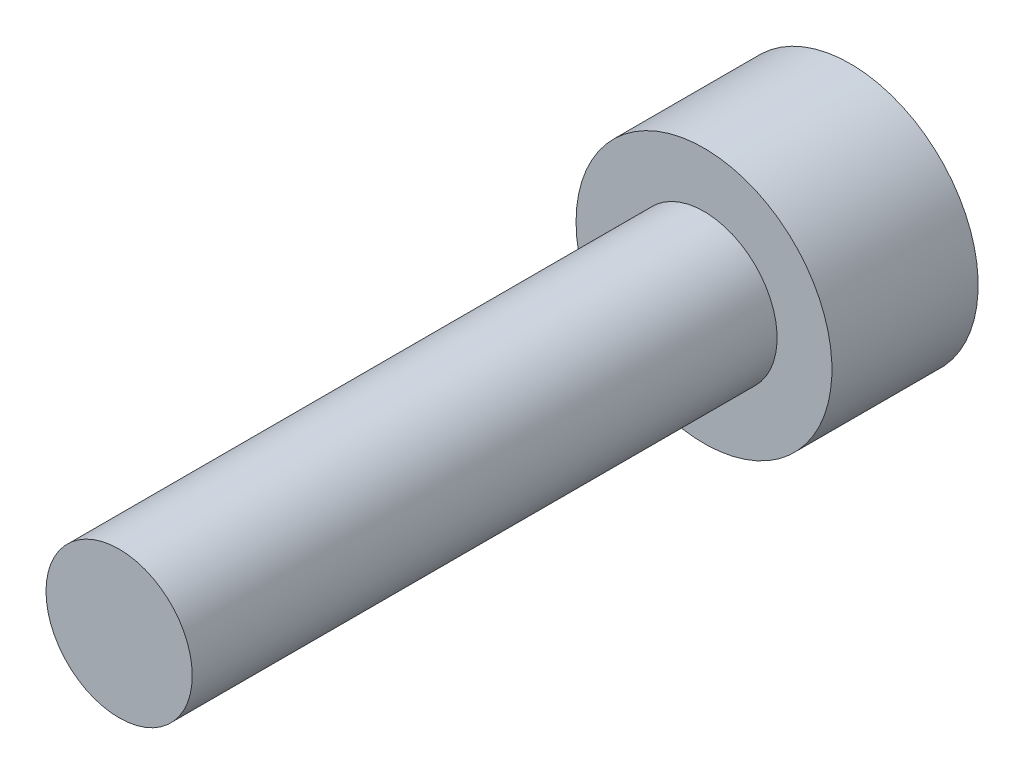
ISO-10303-21;
HEADER;
FILE_DESCRIPTION(('STEP AP214'),'2;1');
FILE_NAME('part.step','',(''),(''),'','','');
FILE_SCHEMA(('AUTOMOTIVE_DESIGN { 1 0 10303 214 1 1 1 1 }'));
ENDSEC;
DATA;
#1=APPLICATION_CONTEXT('core data for automotive mechanical design processes');
#2=APPLICATION_PROTOCOL_DEFINITION('international standard','automotive_design',2000,#1);
#3=PRODUCT_CONTEXT('',#1,'mechanical');
#4=PRODUCT('Part','Part','',(#3));
#5=PRODUCT_RELATED_PRODUCT_CATEGORY('part','',(#4));
#6=PRODUCT_DEFINITION_FORMATION('','',#4);
#7=PRODUCT_DEFINITION_CONTEXT('part definition',#1,'design');
#8=PRODUCT_DEFINITION('design','',#6,#7);
#9=PRODUCT_DEFINITION_SHAPE('','',#8);
#10=(LENGTH_UNIT() NAMED_UNIT(*) SI_UNIT(.MILLI.,.METRE.));
#11=(NAMED_UNIT(*) PLANE_ANGLE_UNIT() SI_UNIT($,.RADIAN.));
#12=(NAMED_UNIT(*) SI_UNIT($,.STERADIAN.) SOLID_ANGLE_UNIT());
#13=UNCERTAINTY_MEASURE_WITH_UNIT(LENGTH_MEASURE(1.E-05),#10,'distance_accuracy_value','');
#14=(GEOMETRIC_REPRESENTATION_CONTEXT(3) GLOBAL_UNCERTAINTY_ASSIGNED_CONTEXT((#13)) GLOBAL_UNIT_ASSIGNED_CONTEXT((#10,
#11,#12)) REPRESENTATION_CONTEXT('',''));
#15=CARTESIAN_POINT('',(0.,0.,0.));
#16=DIRECTION('',(0.,0.,1.));
#17=DIRECTION('',(1.,0.,0.));
#18=AXIS2_PLACEMENT_3D('',#15,#16,#17);
#19=CARTESIAN_POINT('',(0.,0.,16.));
#20=DIRECTION('',(0.,0.,-1.));
#21=DIRECTION('',(-1.,0.,0.));
#22=AXIS2_PLACEMENT_3D('',#19,#20,#21);
#23=CYLINDRICAL_SURFACE('',#22,2.);
#24=CARTESIAN_POINT('',(0.,0.,16.));
#25=DIRECTION('',(0.,0.,1.));
#26=DIRECTION('',(1.,0.,0.));
#27=AXIS2_PLACEMENT_3D('',#24,#25,#26);
#28=CIRCLE('',#27,2.);
#29=CARTESIAN_POINT('',(2.,0.,16.));
#30=VERTEX_POINT('',#29);
#31=EDGE_CURVE('E13',#30,#30,#28,.T.);
#32=ORIENTED_EDGE('',*,*,#31,.F.);
#33=EDGE_LOOP('',(#32));
#34=FACE_BOUND('',#33,.T.);
#35=CARTESIAN_POINT('',(0.,0.,0.));
#36=DIRECTION('',(0.,0.,-1.));
#37=DIRECTION('',(-1.,0.,0.));
#38=AXIS2_PLACEMENT_3D('',#35,#36,#37);
#39=CIRCLE('',#38,2.);
#40=CARTESIAN_POINT('',(-2.,0.,0.));
#41=VERTEX_POINT('',#40);
#42=EDGE_CURVE('E53',#41,#41,#39,.T.);
#43=ORIENTED_EDGE('',*,*,#42,.F.);
#44=EDGE_LOOP('',(#43));
#45=FACE_BOUND('',#44,.T.);
#46=ADVANCED_FACE('F46',(#34,#45),#23,.T.);
#47=CARTESIAN_POINT('',(0.,0.,16.));
#48=DIRECTION('',(0.,0.,1.));
#49=DIRECTION('',(1.,0.,0.));
#50=AXIS2_PLACEMENT_3D('',#47,#48,#49);
#51=PLANE('',#50);
#52=ORIENTED_EDGE('',*,*,#31,.T.);
#53=EDGE_LOOP('',(#52));
#54=FACE_BOUND('',#53,.T.);
#55=ADVANCED_FACE('F165',(#54),#51,.T.);
#56=CARTESIAN_POINT('',(0.,0.,0.));
#57=DIRECTION('',(0.,0.,-1.));
#58=DIRECTION('',(-1.,0.,0.));
#59=AXIS2_PLACEMENT_3D('',#56,#57,#58);
#60=PLANE('',#59);
#61=CARTESIAN_POINT('',(0.,0.,0.));
#62=DIRECTION('',(0.,0.,-1.));
#63=DIRECTION('',(-1.,0.,0.));
#64=AXIS2_PLACEMENT_3D('',#61,#62,#63);
#65=CIRCLE('',#64,3.5);
#66=CARTESIAN_POINT('',(-3.5,0.,0.));
#67=VERTEX_POINT('',#66);
#68=EDGE_CURVE('E148',#67,#67,#65,.T.);
#69=ORIENTED_EDGE('',*,*,#68,.F.);
#70=EDGE_LOOP('',(#69));
#71=FACE_BOUND('',#70,.T.);
#72=ORIENTED_EDGE('',*,*,#42,.T.);
#73=EDGE_LOOP('',(#72));
#74=FACE_BOUND('',#73,.T.);
#75=ADVANCED_FACE('F162',(#71,#74),#60,.F.);
#76=CARTESIAN_POINT('',(0.,0.,-4.));
#77=DIRECTION('',(0.,0.,1.));
#78=DIRECTION('',(1.,0.,0.));
#79=AXIS2_PLACEMENT_3D('',#76,#77,#78);
#80=CYLINDRICAL_SURFACE('',#79,3.5);
#81=CARTESIAN_POINT('',(0.,0.,-4.));
#82=DIRECTION('',(0.,0.,-1.));
#83=DIRECTION('',(-1.,0.,0.));
#84=AXIS2_PLACEMENT_3D('',#81,#82,#83);
#85=CIRCLE('',#84,3.5);
#86=CARTESIAN_POINT('',(-3.5,0.,-4.));
#87=VERTEX_POINT('',#86);
#88=EDGE_CURVE('E157',#87,#87,#85,.T.);
#89=ORIENTED_EDGE('',*,*,#88,.F.);
#90=EDGE_LOOP('',(#89));
#91=FACE_BOUND('',#90,.T.);
#92=ORIENTED_EDGE('',*,*,#68,.T.);
#93=EDGE_LOOP('',(#92));
#94=FACE_BOUND('',#93,.T.);
#95=ADVANCED_FACE('F175',(#91,#94),#80,.T.);
#96=CARTESIAN_POINT('',(0.,0.,-4.));
#97=DIRECTION('',(0.,0.,-1.));
#98=DIRECTION('',(-1.,0.,0.));
#99=AXIS2_PLACEMENT_3D('',#96,#97,#98);
#100=PLANE('',#99);
#101=DIRECTION('',(-0.519705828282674,-0.854345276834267,0.));
#102=VECTOR('',#101,1.);
#103=CARTESIAN_POINT('',(2.10489949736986,-0.048227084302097,-4.));
#104=LINE('',#103,#102);
#105=CARTESIAN_POINT('',(2.10489949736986,-0.048227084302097,-4.));
#106=VERTEX_POINT('',#105);
#107=CARTESIAN_POINT('',(1.01068386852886,-1.84700997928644,-4.));
#108=VERTEX_POINT('',#107);
#109=EDGE_CURVE('E60',#106,#108,#104,.T.);
#110=ORIENTED_EDGE('',*,*,#109,.F.);
#111=DIRECTION('',(0.480031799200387,-0.877251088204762,0.));
#112=VECTOR('',#111,1.);
#113=CARTESIAN_POINT('',(1.094215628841,1.79878289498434,-4.));
#114=LINE('',#113,#112);
#115=CARTESIAN_POINT('',(1.094215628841,1.79878289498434,-4.));
#116=VERTEX_POINT('',#115);
#117=EDGE_CURVE('E130',#116,#106,#114,.T.);
#118=ORIENTED_EDGE('',*,*,#117,.F.);
#119=DIRECTION('',(0.999737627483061,-0.0229058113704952,0.));
#120=VECTOR('',#119,1.);
#121=CARTESIAN_POINT('',(-1.01068386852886,1.84700997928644,-4.));
#122=LINE('',#121,#120);
#123=CARTESIAN_POINT('',(-1.01068386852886,1.84700997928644,-4.));
#124=VERTEX_POINT('',#123);
#125=EDGE_CURVE('E124',#124,#116,#122,.T.);
#126=ORIENTED_EDGE('',*,*,#125,.F.);
#127=DIRECTION('',(0.519705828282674,0.854345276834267,0.));
#128=VECTOR('',#127,1.);
#129=CARTESIAN_POINT('',(-2.10489949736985,0.0482270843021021,-4.));
#130=LINE('',#129,#128);
#131=CARTESIAN_POINT('',(-2.10489949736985,0.0482270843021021,-4.));
#132=VERTEX_POINT('',#131);
#133=EDGE_CURVE('E122',#132,#124,#130,.T.);
#134=ORIENTED_EDGE('',*,*,#133,.F.);
#135=DIRECTION('',(-0.480031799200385,0.877251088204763,0.));
#136=VECTOR('',#135,1.);
#137=CARTESIAN_POINT('',(-1.094215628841,-1.79878289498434,-4.));
#138=LINE('',#137,#136);
#139=CARTESIAN_POINT('',(-1.094215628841,-1.79878289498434,-4.));
#140=VERTEX_POINT('',#139);
#141=EDGE_CURVE('E103',#140,#132,#138,.T.);
#142=ORIENTED_EDGE('',*,*,#141,.F.);
#143=DIRECTION('',(-0.999737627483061,0.0229058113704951,0.));
#144=VECTOR('',#143,1.);
#145=CARTESIAN_POINT('',(1.01068386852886,-1.84700997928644,-4.));
#146=LINE('',#145,#144);
#147=EDGE_CURVE('E114',#108,#140,#146,.T.);
#148=ORIENTED_EDGE('',*,*,#147,.F.);
#149=EDGE_LOOP('',(#110,#118,#126,#134,#142,#148));
#150=FACE_BOUND('',#149,.T.);
#151=ORIENTED_EDGE('',*,*,#88,.T.);
#152=EDGE_LOOP('',(#151));
#153=FACE_BOUND('',#152,.T.);
#154=ADVANCED_FACE('F118',(#150,#153),#100,.T.);
#155=CARTESIAN_POINT('',(2.10489949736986,-0.048227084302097,-1.));
#156=DIRECTION('',(0.854345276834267,-0.519705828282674,0.));
#157=DIRECTION('',(0.519705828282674,0.854345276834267,0.));
#158=AXIS2_PLACEMENT_3D('',#155,#156,#157);
#159=PLANE('',#158);
#160=ORIENTED_EDGE('',*,*,#109,.T.);
#161=DIRECTION('',(0.,0.,-1.));
#162=VECTOR('',#161,1.);
#163=CARTESIAN_POINT('',(1.01068386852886,-1.84700997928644,-1.));
#164=LINE('',#163,#162);
#165=CARTESIAN_POINT('',(1.01068386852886,-1.84700997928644,-1.));
#166=VERTEX_POINT('',#165);
#167=EDGE_CURVE('E111',#166,#108,#164,.T.);
#168=ORIENTED_EDGE('',*,*,#167,.F.);
#169=DIRECTION('',(-0.519705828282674,-0.854345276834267,0.));
#170=VECTOR('',#169,1.);
#171=CARTESIAN_POINT('',(2.10489949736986,-0.048227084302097,-1.));
#172=LINE('',#171,#170);
#173=CARTESIAN_POINT('',(2.10489949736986,-0.048227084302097,-1.));
#174=VERTEX_POINT('',#173);
#175=EDGE_CURVE('E132',#174,#166,#172,.T.);
#176=ORIENTED_EDGE('',*,*,#175,.F.);
#177=DIRECTION('',(0.,0.,-1.));
#178=VECTOR('',#177,1.);
#179=CARTESIAN_POINT('',(2.10489949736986,-0.048227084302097,-1.));
#180=LINE('',#179,#178);
#181=EDGE_CURVE('E67',#174,#106,#180,.T.);
#182=ORIENTED_EDGE('',*,*,#181,.T.);
#183=EDGE_LOOP('',(#160,#168,#176,#182));
#184=FACE_BOUND('',#183,.T.);
#185=ADVANCED_FACE('F183',(#184),#159,.F.);
#186=CARTESIAN_POINT('',(1.094215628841,1.79878289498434,-1.));
#187=DIRECTION('',(0.877251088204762,0.480031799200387,0.));
#188=DIRECTION('',(-0.480031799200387,0.877251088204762,0.));
#189=AXIS2_PLACEMENT_3D('',#186,#187,#188);
#190=PLANE('',#189);
#191=ORIENTED_EDGE('',*,*,#117,.T.);
#192=ORIENTED_EDGE('',*,*,#181,.F.);
#193=DIRECTION('',(0.480031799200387,-0.877251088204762,0.));
#194=VECTOR('',#193,1.);
#195=CARTESIAN_POINT('',(1.094215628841,1.79878289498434,-1.));
#196=LINE('',#195,#194);
#197=CARTESIAN_POINT('',(1.094215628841,1.79878289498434,-1.));
#198=VERTEX_POINT('',#197);
#199=EDGE_CURVE('E144',#198,#174,#196,.T.);
#200=ORIENTED_EDGE('',*,*,#199,.F.);
#201=DIRECTION('',(0.,0.,-1.));
#202=VECTOR('',#201,1.);
#203=CARTESIAN_POINT('',(1.094215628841,1.79878289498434,-1.));
#204=LINE('',#203,#202);
#205=EDGE_CURVE('E149',#198,#116,#204,.T.);
#206=ORIENTED_EDGE('',*,*,#205,.T.);
#207=EDGE_LOOP('',(#191,#192,#200,#206));
#208=FACE_BOUND('',#207,.T.);
#209=ADVANCED_FACE('F187',(#208),#190,.F.);
#210=CARTESIAN_POINT('',(-1.01068386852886,1.84700997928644,-1.));
#211=DIRECTION('',(0.0229058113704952,0.999737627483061,0.));
#212=DIRECTION('',(-0.999737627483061,0.0229058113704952,0.));
#213=AXIS2_PLACEMENT_3D('',#210,#211,#212);
#214=PLANE('',#213);
#215=ORIENTED_EDGE('',*,*,#125,.T.);
#216=ORIENTED_EDGE('',*,*,#205,.F.);
#217=DIRECTION('',(0.999737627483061,-0.0229058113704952,0.));
#218=VECTOR('',#217,1.);
#219=CARTESIAN_POINT('',(-1.01068386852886,1.84700997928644,-1.));
#220=LINE('',#219,#218);
#221=CARTESIAN_POINT('',(-1.01068386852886,1.84700997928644,-1.));
#222=VERTEX_POINT('',#221);
#223=EDGE_CURVE('E141',#222,#198,#220,.T.);
#224=ORIENTED_EDGE('',*,*,#223,.F.);
#225=DIRECTION('',(0.,0.,-1.));
#226=VECTOR('',#225,1.);
#227=CARTESIAN_POINT('',(-1.01068386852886,1.84700997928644,-1.));
#228=LINE('',#227,#226);
#229=EDGE_CURVE('E151',#222,#124,#228,.T.);
#230=ORIENTED_EDGE('',*,*,#229,.T.);
#231=EDGE_LOOP('',(#215,#216,#224,#230));
#232=FACE_BOUND('',#231,.T.);
#233=ADVANCED_FACE('F196',(#232),#214,.F.);
#234=CARTESIAN_POINT('',(-2.10489949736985,0.0482270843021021,-1.));
#235=DIRECTION('',(-0.854345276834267,0.519705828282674,0.));
#236=DIRECTION('',(-0.519705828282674,-0.854345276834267,0.));
#237=AXIS2_PLACEMENT_3D('',#234,#235,#236);
#238=PLANE('',#237);
#239=ORIENTED_EDGE('',*,*,#133,.T.);
#240=ORIENTED_EDGE('',*,*,#229,.F.);
#241=DIRECTION('',(0.519705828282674,0.854345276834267,0.));
#242=VECTOR('',#241,1.);
#243=CARTESIAN_POINT('',(-2.10489949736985,0.0482270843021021,-1.));
#244=LINE('',#243,#242);
#245=CARTESIAN_POINT('',(-2.10489949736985,0.0482270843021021,-1.));
#246=VERTEX_POINT('',#245);
#247=EDGE_CURVE('E138',#246,#222,#244,.T.);
#248=ORIENTED_EDGE('',*,*,#247,.F.);
#249=DIRECTION('',(0.,0.,-1.));
#250=VECTOR('',#249,1.);
#251=CARTESIAN_POINT('',(-2.10489949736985,0.0482270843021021,-1.));
#252=LINE('',#251,#250);
#253=EDGE_CURVE('E110',#246,#132,#252,.T.);
#254=ORIENTED_EDGE('',*,*,#253,.T.);
#255=EDGE_LOOP('',(#239,#240,#248,#254));
#256=FACE_BOUND('',#255,.T.);
#257=ADVANCED_FACE('F193',(#256),#238,.F.);
#258=CARTESIAN_POINT('',(-1.094215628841,-1.79878289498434,-1.));
#259=DIRECTION('',(-0.877251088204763,-0.480031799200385,0.));
#260=DIRECTION('',(0.480031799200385,-0.877251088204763,0.));
#261=AXIS2_PLACEMENT_3D('',#258,#259,#260);
#262=PLANE('',#261);
#263=ORIENTED_EDGE('',*,*,#141,.T.);
#264=ORIENTED_EDGE('',*,*,#253,.F.);
#265=DIRECTION('',(-0.480031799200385,0.877251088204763,0.));
#266=VECTOR('',#265,1.);
#267=CARTESIAN_POINT('',(-1.094215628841,-1.79878289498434,-1.));
#268=LINE('',#267,#266);
#269=CARTESIAN_POINT('',(-1.094215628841,-1.79878289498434,-1.));
#270=VERTEX_POINT('',#269);
#271=EDGE_CURVE('E106',#270,#246,#268,.T.);
#272=ORIENTED_EDGE('',*,*,#271,.F.);
#273=DIRECTION('',(0.,0.,-1.));
#274=VECTOR('',#273,1.);
#275=CARTESIAN_POINT('',(-1.094215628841,-1.79878289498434,-1.));
#276=LINE('',#275,#274);
#277=EDGE_CURVE('E99',#270,#140,#276,.T.);
#278=ORIENTED_EDGE('',*,*,#277,.T.);
#279=EDGE_LOOP('',(#263,#264,#272,#278));
#280=FACE_BOUND('',#279,.T.);
#281=ADVANCED_FACE('F101',(#280),#262,.F.);
#282=CARTESIAN_POINT('',(1.01068386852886,-1.84700997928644,-1.));
#283=DIRECTION('',(-0.0229058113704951,-0.999737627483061,0.));
#284=DIRECTION('',(0.999737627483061,-0.0229058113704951,0.));
#285=AXIS2_PLACEMENT_3D('',#282,#283,#284);
#286=PLANE('',#285);
#287=ORIENTED_EDGE('',*,*,#147,.T.);
#288=ORIENTED_EDGE('',*,*,#277,.F.);
#289=DIRECTION('',(-0.999737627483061,0.0229058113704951,0.));
#290=VECTOR('',#289,1.);
#291=CARTESIAN_POINT('',(1.01068386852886,-1.84700997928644,-1.));
#292=LINE('',#291,#290);
#293=EDGE_CURVE('E135',#166,#270,#292,.T.);
#294=ORIENTED_EDGE('',*,*,#293,.F.);
#295=ORIENTED_EDGE('',*,*,#167,.T.);
#296=EDGE_LOOP('',(#287,#288,#294,#295));
#297=FACE_BOUND('',#296,.T.);
#298=ADVANCED_FACE('F115',(#297),#286,.F.);
#299=CARTESIAN_POINT('',(1.01068386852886,-1.84700997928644,-1.));
#300=DIRECTION('',(0.,0.,-1.));
#301=DIRECTION('',(-1.,0.,0.));
#302=AXIS2_PLACEMENT_3D('',#299,#300,#301);
#303=PLANE('',#302);
#304=ORIENTED_EDGE('',*,*,#175,.T.);
#305=ORIENTED_EDGE('',*,*,#293,.T.);
#306=ORIENTED_EDGE('',*,*,#271,.T.);
#307=ORIENTED_EDGE('',*,*,#247,.T.);
#308=ORIENTED_EDGE('',*,*,#223,.T.);
#309=ORIENTED_EDGE('',*,*,#199,.T.);
#310=EDGE_LOOP('',(#304,#305,#306,#307,#308,#309));
#311=FACE_BOUND('',#310,.T.);
#312=ADVANCED_FACE('F190',(#311),#303,.T.);
#313=CLOSED_SHELL('',(#46,#55,#75,#95,#154,#185,#209,#233,#257,#281,#298,#312));
#314=MANIFOLD_SOLID_BREP('B2',#313);
#315=ADVANCED_BREP_SHAPE_REPRESENTATION('',(#18,#314),#14);
#316=SHAPE_DEFINITION_REPRESENTATION(#9,#315);
ENDSEC;
END-ISO-10303-21;
